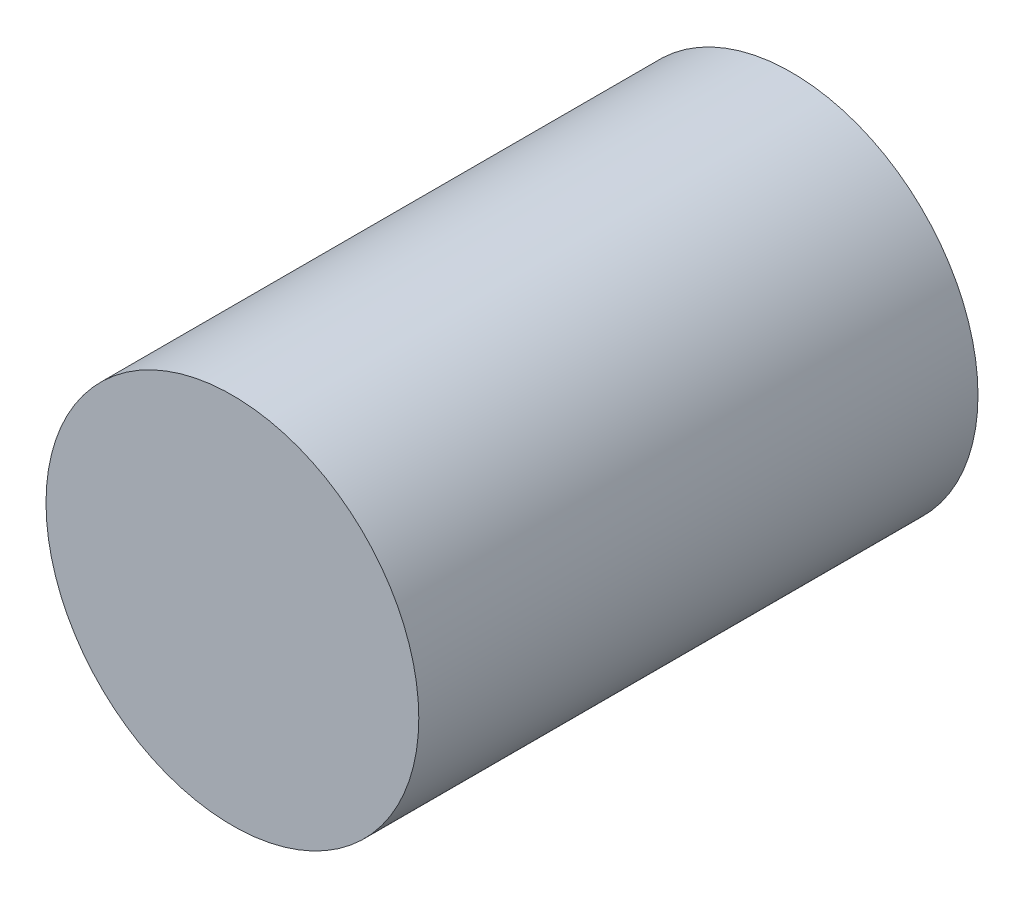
from build123d import *

# Parameters (mm, degrees)
ESQUISSE1_R      = 4
EXTRUSION1_DEPTH = 12


with BuildPart() as part:
    # Esquisse1 → Extrusion1 (new body)
    with BuildSketch(Plane.XY):
        Circle(ESQUISSE1_R)
    extrude(amount=EXTRUSION1_DEPTH)


solid = part.part
